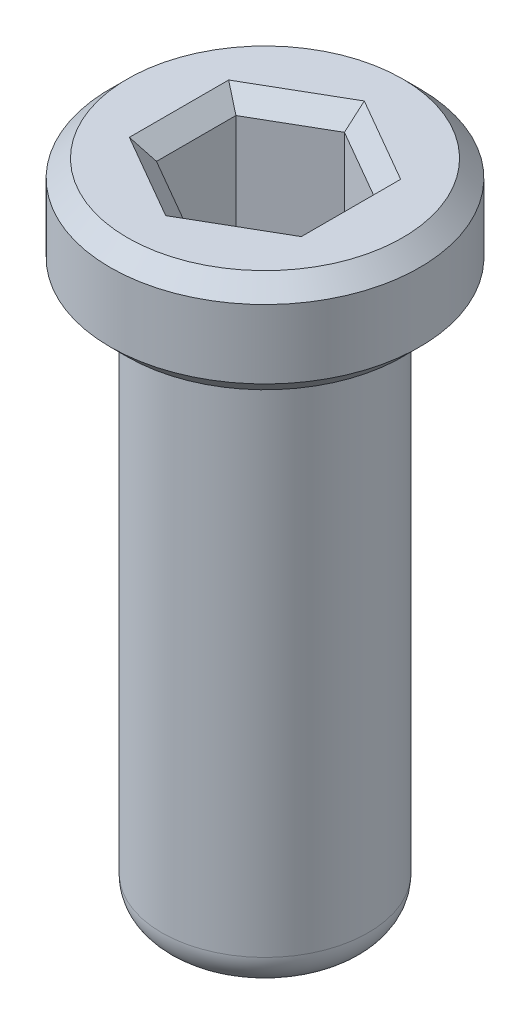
ISO-10303-21;
HEADER;
FILE_DESCRIPTION(('STEP AP214'),'2;1');
FILE_NAME('part.step','',(''),(''),'','','');
FILE_SCHEMA(('AUTOMOTIVE_DESIGN { 1 0 10303 214 1 1 1 1 }'));
ENDSEC;
DATA;
#1=APPLICATION_CONTEXT('core data for automotive mechanical design processes');
#2=APPLICATION_PROTOCOL_DEFINITION('international standard','automotive_design',2000,#1);
#3=PRODUCT_CONTEXT('',#1,'mechanical');
#4=PRODUCT('Part','Part','',(#3));
#5=PRODUCT_RELATED_PRODUCT_CATEGORY('part','',(#4));
#6=PRODUCT_DEFINITION_FORMATION('','',#4);
#7=PRODUCT_DEFINITION_CONTEXT('part definition',#1,'design');
#8=PRODUCT_DEFINITION('design','',#6,#7);
#9=PRODUCT_DEFINITION_SHAPE('','',#8);
#10=(LENGTH_UNIT() NAMED_UNIT(*) SI_UNIT(.MILLI.,.METRE.));
#11=(NAMED_UNIT(*) PLANE_ANGLE_UNIT() SI_UNIT($,.RADIAN.));
#12=(NAMED_UNIT(*) SI_UNIT($,.STERADIAN.) SOLID_ANGLE_UNIT());
#13=UNCERTAINTY_MEASURE_WITH_UNIT(LENGTH_MEASURE(1.E-05),#10,'distance_accuracy_value','');
#14=(GEOMETRIC_REPRESENTATION_CONTEXT(3) GLOBAL_UNCERTAINTY_ASSIGNED_CONTEXT((#13)) GLOBAL_UNIT_ASSIGNED_CONTEXT((#10,
#11,#12)) REPRESENTATION_CONTEXT('',''));
#15=CARTESIAN_POINT('',(0.,0.,0.));
#16=DIRECTION('',(0.,0.,1.));
#17=DIRECTION('',(1.,0.,0.));
#18=AXIS2_PLACEMENT_3D('',#15,#16,#17);
#19=CARTESIAN_POINT('',(0.,8.,0.));
#20=DIRECTION('',(0.,-1.,0.));
#21=DIRECTION('',(0.,0.,-1.));
#22=AXIS2_PLACEMENT_3D('',#19,#20,#21);
#23=CYLINDRICAL_SURFACE('',#22,1.5);
#24=CARTESIAN_POINT('',(0.,0.5,0.));
#25=DIRECTION('',(0.,1.,0.));
#26=DIRECTION('',(0.,0.,1.));
#27=AXIS2_PLACEMENT_3D('',#24,#25,#26);
#28=CIRCLE('',#27,1.5);
#29=CARTESIAN_POINT('',(0.,0.5,1.5));
#30=VERTEX_POINT('',#29);
#31=EDGE_CURVE('E51',#30,#30,#28,.T.);
#32=ORIENTED_EDGE('',*,*,#31,.T.);
#33=EDGE_LOOP('',(#32));
#34=FACE_BOUND('',#33,.T.);
#35=CARTESIAN_POINT('',(0.,8.,0.));
#36=DIRECTION('',(0.,1.,0.));
#37=DIRECTION('',(0.,0.,1.));
#38=AXIS2_PLACEMENT_3D('',#35,#36,#37);
#39=CIRCLE('',#38,1.5);
#40=CARTESIAN_POINT('',(0.,8.,1.5));
#41=VERTEX_POINT('',#40);
#42=EDGE_CURVE('E155',#41,#41,#39,.T.);
#43=ORIENTED_EDGE('',*,*,#42,.F.);
#44=EDGE_LOOP('',(#43));
#45=FACE_BOUND('',#44,.T.);
#46=ADVANCED_FACE('F43',(#34,#45),#23,.T.);
#47=CARTESIAN_POINT('',(0.,0.,0.));
#48=DIRECTION('',(0.,1.,0.));
#49=DIRECTION('',(0.,0.,1.));
#50=AXIS2_PLACEMENT_3D('',#47,#48,#49);
#51=PLANE('',#50);
#52=CARTESIAN_POINT('',(0.,0.,0.));
#53=DIRECTION('',(0.,1.,0.));
#54=DIRECTION('',(0.,0.,1.));
#55=AXIS2_PLACEMENT_3D('',#52,#53,#54);
#56=CIRCLE('',#55,1.);
#57=CARTESIAN_POINT('',(0.,0.,1.));
#58=VERTEX_POINT('',#57);
#59=EDGE_CURVE('E11',#58,#58,#56,.F.);
#60=ORIENTED_EDGE('',*,*,#59,.T.);
#61=EDGE_LOOP('',(#60));
#62=FACE_BOUND('',#61,.T.);
#63=ADVANCED_FACE('F229',(#62),#51,.F.);
#64=CARTESIAN_POINT('',(0.,9.5,0.));
#65=DIRECTION('',(0.,-1.,0.));
#66=DIRECTION('',(0.,0.,-1.));
#67=AXIS2_PLACEMENT_3D('',#64,#65,#66);
#68=CYLINDRICAL_SURFACE('',#67,2.25);
#69=CARTESIAN_POINT('',(0.,8.25,0.));
#70=DIRECTION('',(0.,1.,0.));
#71=DIRECTION('',(0.,0.,1.));
#72=AXIS2_PLACEMENT_3D('',#69,#70,#71);
#73=CIRCLE('',#72,2.25);
#74=CARTESIAN_POINT('',(0.,8.25,2.25));
#75=VERTEX_POINT('',#74);
#76=EDGE_CURVE('E169',#75,#75,#73,.T.);
#77=ORIENTED_EDGE('',*,*,#76,.T.);
#78=EDGE_LOOP('',(#77));
#79=FACE_BOUND('',#78,.T.);
#80=CARTESIAN_POINT('',(0.,9.25,0.));
#81=DIRECTION('',(0.,1.,0.));
#82=DIRECTION('',(0.,0.,1.));
#83=AXIS2_PLACEMENT_3D('',#80,#81,#82);
#84=CIRCLE('',#83,2.25);
#85=CARTESIAN_POINT('',(0.,9.25,2.25));
#86=VERTEX_POINT('',#85);
#87=EDGE_CURVE('E166',#86,#86,#84,.F.);
#88=ORIENTED_EDGE('',*,*,#87,.T.);
#89=EDGE_LOOP('',(#88));
#90=FACE_BOUND('',#89,.T.);
#91=ADVANCED_FACE('F233',(#79,#90),#68,.T.);
#92=CARTESIAN_POINT('',(0.,9.5,0.));
#93=DIRECTION('',(0.,1.,0.));
#94=DIRECTION('',(0.,0.,1.));
#95=AXIS2_PLACEMENT_3D('',#92,#93,#94);
#96=PLANE('',#95);
#97=CARTESIAN_POINT('',(0.,9.5,0.));
#98=DIRECTION('',(0.,1.,0.));
#99=DIRECTION('',(0.,0.,1.));
#100=AXIS2_PLACEMENT_3D('',#97,#98,#99);
#101=CIRCLE('',#100,2.);
#102=CARTESIAN_POINT('',(0.,9.5,2.));
#103=VERTEX_POINT('',#102);
#104=EDGE_CURVE('E188',#103,#103,#101,.T.);
#105=ORIENTED_EDGE('',*,*,#104,.T.);
#106=EDGE_LOOP('',(#105));
#107=FACE_BOUND('',#106,.T.);
#108=DIRECTION('',(-0.866025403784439,0.,0.5));
#109=VECTOR('',#108,1.);
#110=CARTESIAN_POINT('',(0.125000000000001,9.5,1.37120688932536));
#111=LINE('',#110,#109);
#112=CARTESIAN_POINT('',(1.25,9.5,0.721687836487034));
#113=VERTEX_POINT('',#112);
#114=CARTESIAN_POINT('',(0.,9.5,1.44337567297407));
#115=VERTEX_POINT('',#114);
#116=EDGE_CURVE('E175',#113,#115,#111,.T.);
#117=ORIENTED_EDGE('',*,*,#116,.T.);
#118=DIRECTION('',(-0.866025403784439,0.,-0.5));
#119=VECTOR('',#118,1.);
#120=CARTESIAN_POINT('',(-1.125,9.5,0.793856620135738));
#121=LINE('',#120,#119);
#122=CARTESIAN_POINT('',(-1.25,9.5,0.721687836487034));
#123=VERTEX_POINT('',#122);
#124=EDGE_CURVE('E185',#115,#123,#121,.T.);
#125=ORIENTED_EDGE('',*,*,#124,.T.);
#126=DIRECTION('',(0.,0.,-1.));
#127=VECTOR('',#126,1.);
#128=CARTESIAN_POINT('',(-1.25,9.5,-0.577350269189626));
#129=LINE('',#128,#127);
#130=CARTESIAN_POINT('',(-1.25,9.5,-0.721687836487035));
#131=VERTEX_POINT('',#130);
#132=EDGE_CURVE('E183',#123,#131,#129,.T.);
#133=ORIENTED_EDGE('',*,*,#132,.T.);
#134=DIRECTION('',(0.866025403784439,0.,-0.5));
#135=VECTOR('',#134,1.);
#136=CARTESIAN_POINT('',(-0.125000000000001,9.5,-1.37120688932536));
#137=LINE('',#136,#135);
#138=CARTESIAN_POINT('',(0.,9.5,-1.44337567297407));
#139=VERTEX_POINT('',#138);
#140=EDGE_CURVE('E181',#131,#139,#137,.T.);
#141=ORIENTED_EDGE('',*,*,#140,.T.);
#142=DIRECTION('',(0.866025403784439,0.,0.5));
#143=VECTOR('',#142,1.);
#144=CARTESIAN_POINT('',(1.125,9.5,-0.793856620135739));
#145=LINE('',#144,#143);
#146=CARTESIAN_POINT('',(1.25,9.5,-0.721687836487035));
#147=VERTEX_POINT('',#146);
#148=EDGE_CURVE('E179',#139,#147,#145,.T.);
#149=ORIENTED_EDGE('',*,*,#148,.T.);
#150=DIRECTION('',(0.,0.,1.));
#151=VECTOR('',#150,1.);
#152=CARTESIAN_POINT('',(1.25,9.5,0.577350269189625));
#153=LINE('',#152,#151);
#154=EDGE_CURVE('E177',#147,#113,#153,.T.);
#155=ORIENTED_EDGE('',*,*,#154,.T.);
#156=EDGE_LOOP('',(#117,#125,#133,#141,#149,#155));
#157=FACE_BOUND('',#156,.T.);
#158=ADVANCED_FACE('F295',(#107,#157),#96,.T.);
#159=CARTESIAN_POINT('',(0.,8.,0.));
#160=DIRECTION('',(0.,1.,0.));
#161=DIRECTION('',(0.,0.,1.));
#162=AXIS2_PLACEMENT_3D('',#159,#160,#161);
#163=PLANE('',#162);
#164=CARTESIAN_POINT('',(0.,8.,0.));
#165=DIRECTION('',(0.,1.,0.));
#166=DIRECTION('',(0.,0.,1.));
#167=AXIS2_PLACEMENT_3D('',#164,#165,#166);
#168=CIRCLE('',#167,2.);
#169=CARTESIAN_POINT('',(0.,8.,2.));
#170=VERTEX_POINT('',#169);
#171=EDGE_CURVE('E172',#170,#170,#168,.F.);
#172=ORIENTED_EDGE('',*,*,#171,.T.);
#173=EDGE_LOOP('',(#172));
#174=FACE_BOUND('',#173,.T.);
#175=ORIENTED_EDGE('',*,*,#42,.T.);
#176=EDGE_LOOP('',(#175));
#177=FACE_BOUND('',#176,.T.);
#178=ADVANCED_FACE('F329',(#174,#177),#163,.F.);
#179=CARTESIAN_POINT('',(1.,7.5,-0.577350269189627));
#180=DIRECTION('',(0.5,0.,-0.866025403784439));
#181=DIRECTION('',(-0.866025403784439,0.,-0.5));
#182=AXIS2_PLACEMENT_3D('',#179,#180,#181);
#183=PLANE('',#182);
#184=DIRECTION('',(0.,1.,0.));
#185=VECTOR('',#184,1.);
#186=CARTESIAN_POINT('',(1.,7.5,-0.577350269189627));
#187=LINE('',#186,#185);
#188=CARTESIAN_POINT('',(1.,7.5,-0.577350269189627));
#189=VERTEX_POINT('',#188);
#190=CARTESIAN_POINT('',(1.,9.25,-0.577350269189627));
#191=VERTEX_POINT('',#190);
#192=EDGE_CURVE('E153',#189,#191,#187,.T.);
#193=ORIENTED_EDGE('',*,*,#192,.T.);
#194=DIRECTION('',(-0.866025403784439,0.,-0.5));
#195=VECTOR('',#194,1.);
#196=CARTESIAN_POINT('',(0.,9.25,-1.15470053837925));
#197=LINE('',#196,#195);
#198=CARTESIAN_POINT('',(0.,9.25,-1.15470053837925));
#199=VERTEX_POINT('',#198);
#200=EDGE_CURVE('E122',#191,#199,#197,.T.);
#201=ORIENTED_EDGE('',*,*,#200,.T.);
#202=DIRECTION('',(0.,1.,0.));
#203=VECTOR('',#202,1.);
#204=CARTESIAN_POINT('',(0.,7.5,-1.15470053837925));
#205=LINE('',#204,#203);
#206=CARTESIAN_POINT('',(0.,7.5,-1.15470053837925));
#207=VERTEX_POINT('',#206);
#208=EDGE_CURVE('E115',#207,#199,#205,.T.);
#209=ORIENTED_EDGE('',*,*,#208,.F.);
#210=DIRECTION('',(-0.866025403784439,0.,-0.5));
#211=VECTOR('',#210,1.);
#212=CARTESIAN_POINT('',(1.,7.5,-0.577350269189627));
#213=LINE('',#212,#211);
#214=EDGE_CURVE('E119',#189,#207,#213,.T.);
#215=ORIENTED_EDGE('',*,*,#214,.F.);
#216=EDGE_LOOP('',(#193,#201,#209,#215));
#217=FACE_BOUND('',#216,.T.);
#218=ADVANCED_FACE('F117',(#217),#183,.F.);
#219=CARTESIAN_POINT('',(1.,7.5,0.577350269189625));
#220=DIRECTION('',(1.,0.,0.));
#221=DIRECTION('',(0.,0.,-1.));
#222=AXIS2_PLACEMENT_3D('',#219,#220,#221);
#223=PLANE('',#222);
#224=DIRECTION('',(0.,1.,0.));
#225=VECTOR('',#224,1.);
#226=CARTESIAN_POINT('',(1.,7.5,0.577350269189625));
#227=LINE('',#226,#225);
#228=CARTESIAN_POINT('',(1.,7.5,0.577350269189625));
#229=VERTEX_POINT('',#228);
#230=CARTESIAN_POINT('',(1.,9.25,0.577350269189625));
#231=VERTEX_POINT('',#230);
#232=EDGE_CURVE('E156',#229,#231,#227,.T.);
#233=ORIENTED_EDGE('',*,*,#232,.T.);
#234=DIRECTION('',(0.,0.,-1.));
#235=VECTOR('',#234,1.);
#236=CARTESIAN_POINT('',(1.,9.25,-0.577350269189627));
#237=LINE('',#236,#235);
#238=EDGE_CURVE('E65',#231,#191,#237,.T.);
#239=ORIENTED_EDGE('',*,*,#238,.T.);
#240=ORIENTED_EDGE('',*,*,#192,.F.);
#241=DIRECTION('',(0.,0.,-1.));
#242=VECTOR('',#241,1.);
#243=CARTESIAN_POINT('',(1.,7.5,0.577350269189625));
#244=LINE('',#243,#242);
#245=EDGE_CURVE('E126',#229,#189,#244,.T.);
#246=ORIENTED_EDGE('',*,*,#245,.F.);
#247=EDGE_LOOP('',(#233,#239,#240,#246));
#248=FACE_BOUND('',#247,.T.);
#249=ADVANCED_FACE('F310',(#248),#223,.F.);
#250=CARTESIAN_POINT('',(0.,7.5,1.15470053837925));
#251=DIRECTION('',(0.5,0.,0.866025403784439));
#252=DIRECTION('',(0.866025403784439,0.,-0.5));
#253=AXIS2_PLACEMENT_3D('',#250,#251,#252);
#254=PLANE('',#253);
#255=DIRECTION('',(0.,1.,0.));
#256=VECTOR('',#255,1.);
#257=CARTESIAN_POINT('',(0.,7.5,1.15470053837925));
#258=LINE('',#257,#256);
#259=CARTESIAN_POINT('',(0.,7.5,1.15470053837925));
#260=VERTEX_POINT('',#259);
#261=CARTESIAN_POINT('',(0.,9.25,1.15470053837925));
#262=VERTEX_POINT('',#261);
#263=EDGE_CURVE('E158',#260,#262,#258,.T.);
#264=ORIENTED_EDGE('',*,*,#263,.T.);
#265=DIRECTION('',(0.866025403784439,0.,-0.5));
#266=VECTOR('',#265,1.);
#267=CARTESIAN_POINT('',(1.,9.25,0.577350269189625));
#268=LINE('',#267,#266);
#269=EDGE_CURVE('E58',#262,#231,#268,.T.);
#270=ORIENTED_EDGE('',*,*,#269,.T.);
#271=ORIENTED_EDGE('',*,*,#232,.F.);
#272=DIRECTION('',(0.866025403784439,0.,-0.5));
#273=VECTOR('',#272,1.);
#274=CARTESIAN_POINT('',(0.,7.5,1.15470053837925));
#275=LINE('',#274,#273);
#276=EDGE_CURVE('E150',#260,#229,#275,.T.);
#277=ORIENTED_EDGE('',*,*,#276,.F.);
#278=EDGE_LOOP('',(#264,#270,#271,#277));
#279=FACE_BOUND('',#278,.T.);
#280=ADVANCED_FACE('F312',(#279),#254,.F.);
#281=CARTESIAN_POINT('',(-1.,7.5,0.577350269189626));
#282=DIRECTION('',(-0.5,0.,0.866025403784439));
#283=DIRECTION('',(0.866025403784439,0.,0.5));
#284=AXIS2_PLACEMENT_3D('',#281,#282,#283);
#285=PLANE('',#284);
#286=DIRECTION('',(0.,1.,0.));
#287=VECTOR('',#286,1.);
#288=CARTESIAN_POINT('',(-1.,7.5,0.577350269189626));
#289=LINE('',#288,#287);
#290=CARTESIAN_POINT('',(-1.,7.5,0.577350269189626));
#291=VERTEX_POINT('',#290);
#292=CARTESIAN_POINT('',(-1.,9.25,0.577350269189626));
#293=VERTEX_POINT('',#292);
#294=EDGE_CURVE('E160',#291,#293,#289,.T.);
#295=ORIENTED_EDGE('',*,*,#294,.T.);
#296=DIRECTION('',(0.866025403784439,0.,0.5));
#297=VECTOR('',#296,1.);
#298=CARTESIAN_POINT('',(0.,9.25,1.15470053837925));
#299=LINE('',#298,#297);
#300=EDGE_CURVE('E191',#293,#262,#299,.T.);
#301=ORIENTED_EDGE('',*,*,#300,.T.);
#302=ORIENTED_EDGE('',*,*,#263,.F.);
#303=DIRECTION('',(0.866025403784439,0.,0.5));
#304=VECTOR('',#303,1.);
#305=CARTESIAN_POINT('',(-1.,7.5,0.577350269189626));
#306=LINE('',#305,#304);
#307=EDGE_CURVE('E147',#291,#260,#306,.T.);
#308=ORIENTED_EDGE('',*,*,#307,.F.);
#309=EDGE_LOOP('',(#295,#301,#302,#308));
#310=FACE_BOUND('',#309,.T.);
#311=ADVANCED_FACE('F308',(#310),#285,.F.);
#312=CARTESIAN_POINT('',(-1.,7.5,-0.577350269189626));
#313=DIRECTION('',(-1.,0.,0.));
#314=DIRECTION('',(0.,0.,1.));
#315=AXIS2_PLACEMENT_3D('',#312,#313,#314);
#316=PLANE('',#315);
#317=DIRECTION('',(0.,1.,0.));
#318=VECTOR('',#317,1.);
#319=CARTESIAN_POINT('',(-1.,7.5,-0.577350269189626));
#320=LINE('',#319,#318);
#321=CARTESIAN_POINT('',(-1.,7.5,-0.577350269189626));
#322=VERTEX_POINT('',#321);
#323=CARTESIAN_POINT('',(-1.,9.25,-0.577350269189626));
#324=VERTEX_POINT('',#323);
#325=EDGE_CURVE('E125',#322,#324,#320,.T.);
#326=ORIENTED_EDGE('',*,*,#325,.T.);
#327=DIRECTION('',(0.,0.,1.));
#328=VECTOR('',#327,1.);
#329=CARTESIAN_POINT('',(-1.,9.25,0.577350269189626));
#330=LINE('',#329,#328);
#331=EDGE_CURVE('E194',#324,#293,#330,.T.);
#332=ORIENTED_EDGE('',*,*,#331,.T.);
#333=ORIENTED_EDGE('',*,*,#294,.F.);
#334=DIRECTION('',(0.,0.,1.));
#335=VECTOR('',#334,1.);
#336=CARTESIAN_POINT('',(-1.,7.5,-0.577350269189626));
#337=LINE('',#336,#335);
#338=EDGE_CURVE('E135',#322,#291,#337,.T.);
#339=ORIENTED_EDGE('',*,*,#338,.F.);
#340=EDGE_LOOP('',(#326,#332,#333,#339));
#341=FACE_BOUND('',#340,.T.);
#342=ADVANCED_FACE('F305',(#341),#316,.F.);
#343=CARTESIAN_POINT('',(0.,7.5,-1.15470053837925));
#344=DIRECTION('',(-0.5,0.,-0.866025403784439));
#345=DIRECTION('',(-0.866025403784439,0.,0.5));
#346=AXIS2_PLACEMENT_3D('',#343,#344,#345);
#347=PLANE('',#346);
#348=ORIENTED_EDGE('',*,*,#208,.T.);
#349=DIRECTION('',(-0.866025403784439,0.,0.5));
#350=VECTOR('',#349,1.);
#351=CARTESIAN_POINT('',(-1.,9.25,-0.577350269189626));
#352=LINE('',#351,#350);
#353=EDGE_CURVE('E196',#199,#324,#352,.T.);
#354=ORIENTED_EDGE('',*,*,#353,.T.);
#355=ORIENTED_EDGE('',*,*,#325,.F.);
#356=DIRECTION('',(-0.866025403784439,0.,0.5));
#357=VECTOR('',#356,1.);
#358=CARTESIAN_POINT('',(0.,7.5,-1.15470053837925));
#359=LINE('',#358,#357);
#360=EDGE_CURVE('E129',#207,#322,#359,.T.);
#361=ORIENTED_EDGE('',*,*,#360,.F.);
#362=EDGE_LOOP('',(#348,#354,#355,#361));
#363=FACE_BOUND('',#362,.T.);
#364=ADVANCED_FACE('F130',(#363),#347,.F.);
#365=CARTESIAN_POINT('',(0.,7.5,0.));
#366=DIRECTION('',(0.,1.,0.));
#367=DIRECTION('',(0.,0.,1.));
#368=AXIS2_PLACEMENT_3D('',#365,#366,#367);
#369=PLANE('',#368);
#370=ORIENTED_EDGE('',*,*,#214,.T.);
#371=ORIENTED_EDGE('',*,*,#360,.T.);
#372=ORIENTED_EDGE('',*,*,#338,.T.);
#373=ORIENTED_EDGE('',*,*,#307,.T.);
#374=ORIENTED_EDGE('',*,*,#276,.T.);
#375=ORIENTED_EDGE('',*,*,#245,.T.);
#376=EDGE_LOOP('',(#370,#371,#372,#373,#374,#375));
#377=FACE_BOUND('',#376,.T.);
#378=ADVANCED_FACE('F137',(#377),#369,.T.);
#379=CARTESIAN_POINT('',(0.,8.25,0.));
#380=DIRECTION('',(0.,1.,0.));
#381=DIRECTION('',(0.,0.,1.));
#382=AXIS2_PLACEMENT_3D('',#379,#380,#381);
#383=CONICAL_SURFACE('',#382,2.25,0.785398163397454);
#384=ORIENTED_EDGE('',*,*,#171,.F.);
#385=EDGE_LOOP('',(#384));
#386=FACE_BOUND('',#385,.T.);
#387=ORIENTED_EDGE('',*,*,#76,.F.);
#388=EDGE_LOOP('',(#387));
#389=FACE_BOUND('',#388,.T.);
#390=ADVANCED_FACE('F239',(#386,#389),#383,.T.);
#391=CARTESIAN_POINT('',(0.,9.5,0.));
#392=DIRECTION('',(0.,-1.,0.));
#393=DIRECTION('',(0.,0.,-1.));
#394=AXIS2_PLACEMENT_3D('',#391,#392,#393);
#395=CONICAL_SURFACE('',#394,2.,0.785398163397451);
#396=ORIENTED_EDGE('',*,*,#87,.F.);
#397=EDGE_LOOP('',(#396));
#398=FACE_BOUND('',#397,.T.);
#399=ORIENTED_EDGE('',*,*,#104,.F.);
#400=EDGE_LOOP('',(#399));
#401=FACE_BOUND('',#400,.T.);
#402=ADVANCED_FACE('F245',(#398,#401),#395,.T.);
#403=CARTESIAN_POINT('',(1.,9.25,-0.577350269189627));
#404=DIRECTION('',(-0.353553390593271,0.707106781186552,0.612372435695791));
#405=DIRECTION('',(0.866025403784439,0.,0.5));
#406=AXIS2_PLACEMENT_3D('',#403,#404,#405);
#407=PLANE('',#406);
#408=DIRECTION('',(-0.654653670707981,-0.654653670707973,0.377964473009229));
#409=VECTOR('',#408,1.);
#410=CARTESIAN_POINT('',(1.,9.25,-0.577350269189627));
#411=LINE('',#410,#409);
#412=EDGE_CURVE('E143',#147,#191,#411,.T.);
#413=ORIENTED_EDGE('',*,*,#412,.F.);
#414=ORIENTED_EDGE('',*,*,#148,.F.);
#415=DIRECTION('',(0.,-0.654653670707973,0.755928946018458));
#416=VECTOR('',#415,1.);
#417=CARTESIAN_POINT('',(0.,9.25,-1.15470053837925));
#418=LINE('',#417,#416);
#419=EDGE_CURVE('E140',#199,#139,#418,.F.);
#420=ORIENTED_EDGE('',*,*,#419,.F.);
#421=ORIENTED_EDGE('',*,*,#200,.F.);
#422=EDGE_LOOP('',(#413,#414,#420,#421));
#423=FACE_BOUND('',#422,.T.);
#424=ADVANCED_FACE('F251',(#423),#407,.T.);
#425=CARTESIAN_POINT('',(0.,9.25,-1.15470053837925));
#426=DIRECTION('',(0.353553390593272,0.707106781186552,0.612372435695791));
#427=DIRECTION('',(0.866025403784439,0.,-0.5));
#428=AXIS2_PLACEMENT_3D('',#425,#426,#427);
#429=PLANE('',#428);
#430=ORIENTED_EDGE('',*,*,#419,.T.);
#431=ORIENTED_EDGE('',*,*,#140,.F.);
#432=DIRECTION('',(0.65465367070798,-0.654653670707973,0.377964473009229));
#433=VECTOR('',#432,1.);
#434=CARTESIAN_POINT('',(-1.,9.25,-0.577350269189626));
#435=LINE('',#434,#433);
#436=EDGE_CURVE('E208',#324,#131,#435,.F.);
#437=ORIENTED_EDGE('',*,*,#436,.F.);
#438=ORIENTED_EDGE('',*,*,#353,.F.);
#439=EDGE_LOOP('',(#430,#431,#437,#438));
#440=FACE_BOUND('',#439,.T.);
#441=ADVANCED_FACE('F277',(#440),#429,.T.);
#442=CARTESIAN_POINT('',(1.,9.25,0.577350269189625));
#443=DIRECTION('',(-0.707106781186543,0.707106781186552,0.));
#444=DIRECTION('',(0.,0.,1.));
#445=AXIS2_PLACEMENT_3D('',#442,#443,#444);
#446=PLANE('',#445);
#447=ORIENTED_EDGE('',*,*,#412,.T.);
#448=ORIENTED_EDGE('',*,*,#238,.F.);
#449=DIRECTION('',(-0.654653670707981,-0.654653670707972,-0.377964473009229));
#450=VECTOR('',#449,1.);
#451=CARTESIAN_POINT('',(1.,9.25,0.577350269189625));
#452=LINE('',#451,#450);
#453=EDGE_CURVE('E205',#113,#231,#452,.T.);
#454=ORIENTED_EDGE('',*,*,#453,.F.);
#455=ORIENTED_EDGE('',*,*,#154,.F.);
#456=EDGE_LOOP('',(#447,#448,#454,#455));
#457=FACE_BOUND('',#456,.T.);
#458=ADVANCED_FACE('F270',(#457),#446,.T.);
#459=CARTESIAN_POINT('',(-1.,9.25,-0.577350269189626));
#460=DIRECTION('',(0.707106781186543,0.707106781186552,0.));
#461=DIRECTION('',(0.,0.,-1.));
#462=AXIS2_PLACEMENT_3D('',#459,#460,#461);
#463=PLANE('',#462);
#464=ORIENTED_EDGE('',*,*,#436,.T.);
#465=ORIENTED_EDGE('',*,*,#132,.F.);
#466=DIRECTION('',(0.654653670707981,-0.654653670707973,-0.377964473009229));
#467=VECTOR('',#466,1.);
#468=CARTESIAN_POINT('',(-1.,9.25,0.577350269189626));
#469=LINE('',#468,#467);
#470=EDGE_CURVE('E203',#293,#123,#469,.F.);
#471=ORIENTED_EDGE('',*,*,#470,.F.);
#472=ORIENTED_EDGE('',*,*,#331,.F.);
#473=EDGE_LOOP('',(#464,#465,#471,#472));
#474=FACE_BOUND('',#473,.T.);
#475=ADVANCED_FACE('F263',(#474),#463,.T.);
#476=CARTESIAN_POINT('',(0.,9.25,1.15470053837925));
#477=DIRECTION('',(-0.353553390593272,0.707106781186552,-0.612372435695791));
#478=DIRECTION('',(-0.866025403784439,0.,0.5));
#479=AXIS2_PLACEMENT_3D('',#476,#477,#478);
#480=PLANE('',#479);
#481=ORIENTED_EDGE('',*,*,#453,.T.);
#482=ORIENTED_EDGE('',*,*,#269,.F.);
#483=DIRECTION('',(0.,0.654653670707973,0.755928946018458));
#484=VECTOR('',#483,1.);
#485=CARTESIAN_POINT('',(0.,8.96428571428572,0.824786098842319));
#486=LINE('',#485,#484);
#487=EDGE_CURVE('E201',#115,#262,#486,.F.);
#488=ORIENTED_EDGE('',*,*,#487,.F.);
#489=ORIENTED_EDGE('',*,*,#116,.F.);
#490=EDGE_LOOP('',(#481,#482,#488,#489));
#491=FACE_BOUND('',#490,.T.);
#492=ADVANCED_FACE('F224',(#491),#480,.T.);
#493=CARTESIAN_POINT('',(-1.,9.25,0.577350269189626));
#494=DIRECTION('',(0.353553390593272,0.707106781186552,-0.612372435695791));
#495=DIRECTION('',(-0.866025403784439,0.,-0.5));
#496=AXIS2_PLACEMENT_3D('',#493,#494,#495);
#497=PLANE('',#496);
#498=ORIENTED_EDGE('',*,*,#470,.T.);
#499=ORIENTED_EDGE('',*,*,#124,.F.);
#500=ORIENTED_EDGE('',*,*,#487,.T.);
#501=ORIENTED_EDGE('',*,*,#300,.F.);
#502=EDGE_LOOP('',(#498,#499,#500,#501));
#503=FACE_BOUND('',#502,.T.);
#504=ADVANCED_FACE('F218',(#503),#497,.T.);
#505=CARTESIAN_POINT('',(0.,0.5,0.));
#506=DIRECTION('',(0.,1.,0.));
#507=DIRECTION('',(0.,0.,1.));
#508=AXIS2_PLACEMENT_3D('',#505,#506,#507);
#509=TOROIDAL_SURFACE('',#508,1.,0.5);
#510=ORIENTED_EDGE('',*,*,#59,.F.);
#511=EDGE_LOOP('',(#510));
#512=FACE_BOUND('',#511,.T.);
#513=ORIENTED_EDGE('',*,*,#31,.F.);
#514=EDGE_LOOP('',(#513));
#515=FACE_BOUND('',#514,.T.);
#516=ADVANCED_FACE('F45',(#512,#515),#509,.T.);
#517=CLOSED_SHELL('',(#46,#63,#91,#158,#178,#218,#249,#280,#311,#342,#364,#378,#390,#402,#424,
#441,#458,#475,#492,#504,#516));
#518=MANIFOLD_SOLID_BREP('B2',#517);
#519=ADVANCED_BREP_SHAPE_REPRESENTATION('',(#18,#518),#14);
#520=SHAPE_DEFINITION_REPRESENTATION(#9,#519);
ENDSEC;
END-ISO-10303-21;
